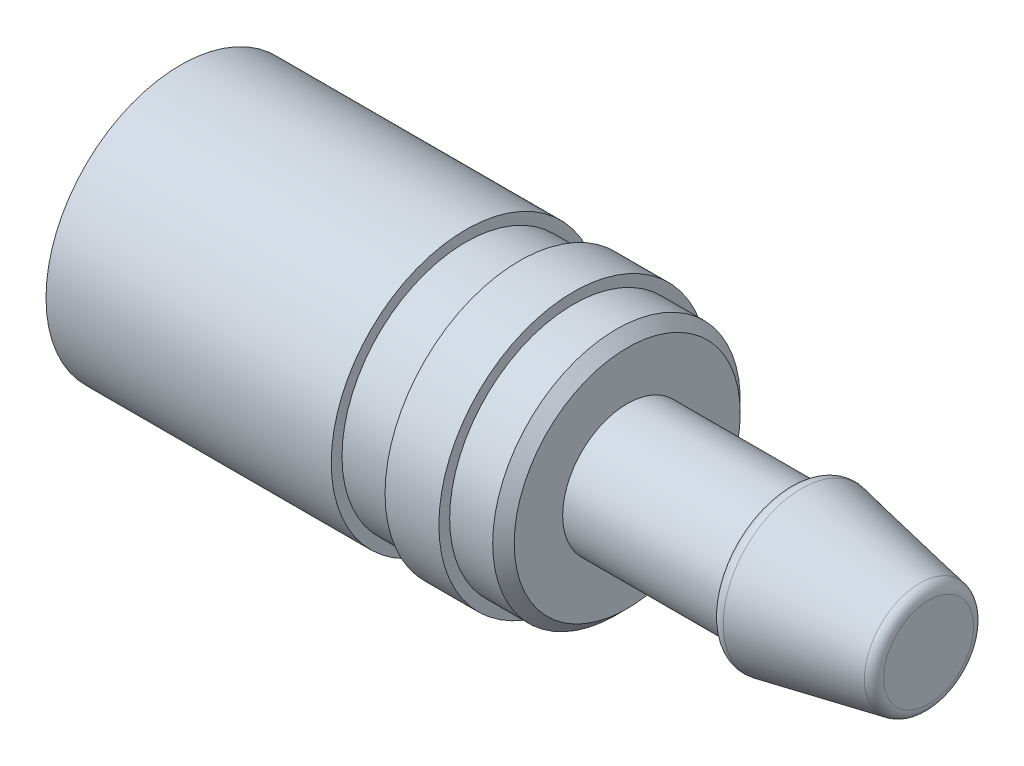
from build123d import *

# Parameters (mm, degrees)
REDONDEO1_R   = 1
CHAFL_N1_SIZE = 1


with BuildPart() as part:
    # Croquis1 → Revoluci_n1 (revolve)
    with BuildSketch(Plane.XY, mode=Mode.PRIVATE) as revoluci_n1_sk:
        Polygon((0, 0), (0, 12.5), (26.5, 12.5), (26.5, 11.5), (31.5, 11.5), (31.5, 12.5), (36.5, 12.5), (36.5, 11.5), (41.5, 11.5), (41.5, 6), (56.5, 6), (56.5, 7.5), (69.5, 5), (69.5, 0), align=None)
    revolve(revoluci_n1_sk.sketch.rotate(Axis((0, 0, 0), (1, 0, 0)), 90), axis=Axis((0, 0, 0), (1, 0, 0)))

    # Redondeo1
    redondeo1_edges = [part.edges().sort_by_distance(p)[0] for p in [
        (56.5, 0, -7.5),
        (69.5, 0, -5),
    ]]
    fillet(redondeo1_edges, radius=REDONDEO1_R)

    # Chafl_n1
    chafl_n1_edges = [part.edges().sort_by_distance(p)[0] for p in [
        (41.5, 0, -11.5),
    ]]
    chamfer(chafl_n1_edges, length=CHAFL_N1_SIZE)


solid = part.part
